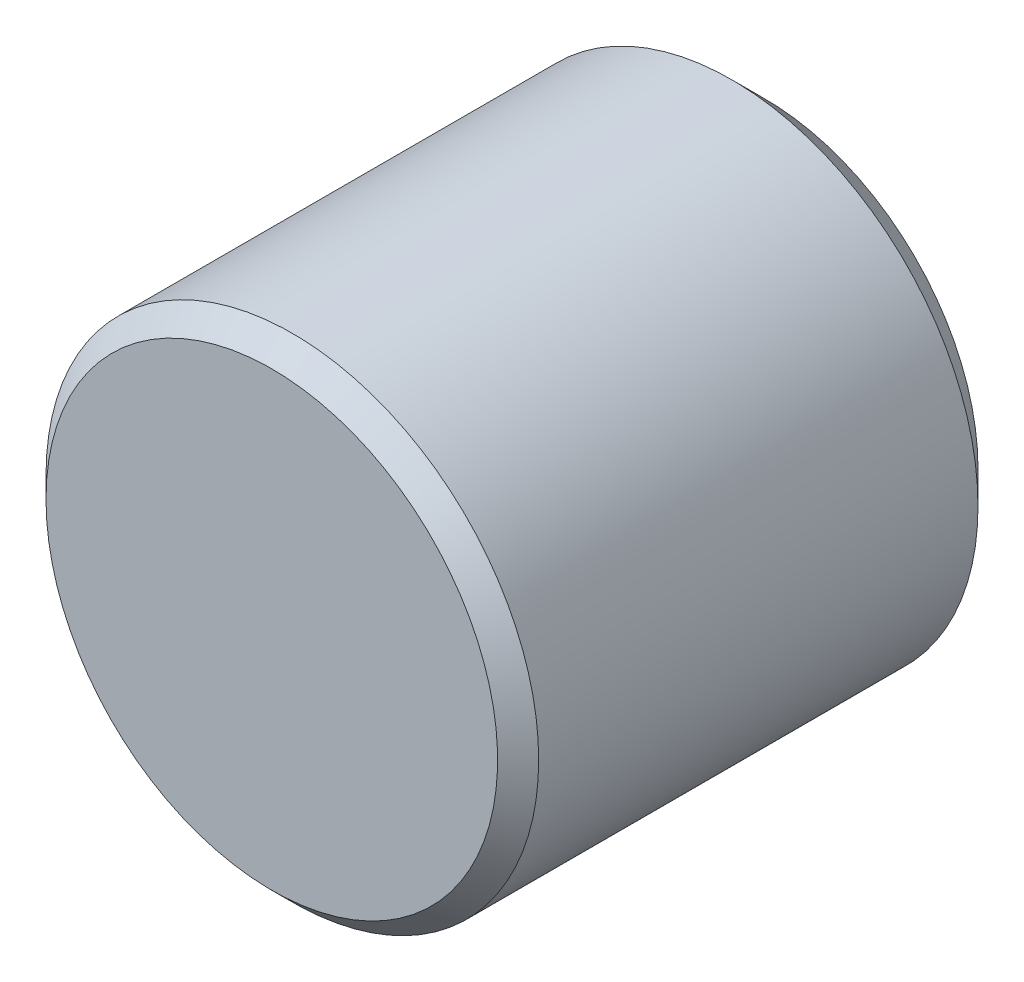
ISO-10303-21;
HEADER;
FILE_DESCRIPTION(('STEP AP214'),'2;1');
FILE_NAME('part.step','',(''),(''),'','','');
FILE_SCHEMA(('AUTOMOTIVE_DESIGN { 1 0 10303 214 1 1 1 1 }'));
ENDSEC;
DATA;
#1=APPLICATION_CONTEXT('core data for automotive mechanical design processes');
#2=APPLICATION_PROTOCOL_DEFINITION('international standard','automotive_design',2000,#1);
#3=PRODUCT_CONTEXT('',#1,'mechanical');
#4=PRODUCT('Part','Part','',(#3));
#5=PRODUCT_RELATED_PRODUCT_CATEGORY('part','',(#4));
#6=PRODUCT_DEFINITION_FORMATION('','',#4);
#7=PRODUCT_DEFINITION_CONTEXT('part definition',#1,'design');
#8=PRODUCT_DEFINITION('design','',#6,#7);
#9=PRODUCT_DEFINITION_SHAPE('','',#8);
#10=(LENGTH_UNIT() NAMED_UNIT(*) SI_UNIT(.MILLI.,.METRE.));
#11=(NAMED_UNIT(*) PLANE_ANGLE_UNIT() SI_UNIT($,.RADIAN.));
#12=(NAMED_UNIT(*) SI_UNIT($,.STERADIAN.) SOLID_ANGLE_UNIT());
#13=UNCERTAINTY_MEASURE_WITH_UNIT(LENGTH_MEASURE(1.E-05),#10,'distance_accuracy_value','');
#14=(GEOMETRIC_REPRESENTATION_CONTEXT(3) GLOBAL_UNCERTAINTY_ASSIGNED_CONTEXT((#13)) GLOBAL_UNIT_ASSIGNED_CONTEXT((#10,
#11,#12)) REPRESENTATION_CONTEXT('',''));
#15=CARTESIAN_POINT('',(0.,0.,0.));
#16=DIRECTION('',(0.,0.,1.));
#17=DIRECTION('',(1.,0.,0.));
#18=AXIS2_PLACEMENT_3D('',#15,#16,#17);
#19=CARTESIAN_POINT('',(0.,0.,32.));
#20=DIRECTION('',(0.,0.,1.));
#21=DIRECTION('',(1.,0.,0.));
#22=AXIS2_PLACEMENT_3D('',#19,#20,#21);
#23=CYLINDRICAL_SURFACE('',#22,6.);
#24=CARTESIAN_POINT('',(0.,0.,0.8));
#25=DIRECTION('',(0.,0.,1.));
#26=DIRECTION('',(1.,0.,0.));
#27=AXIS2_PLACEMENT_3D('',#24,#25,#26);
#28=CIRCLE('',#27,6.);
#29=CARTESIAN_POINT('',(6.,0.,0.8));
#30=VERTEX_POINT('',#29);
#31=EDGE_CURVE('E21',#30,#30,#28,.T.);
#32=ORIENTED_EDGE('',*,*,#31,.T.);
#33=EDGE_LOOP('',(#32));
#34=FACE_BOUND('',#33,.T.);
#35=CARTESIAN_POINT('',(0.,0.,11.5));
#36=DIRECTION('',(0.,0.,-1.));
#37=DIRECTION('',(-1.,0.,0.));
#38=AXIS2_PLACEMENT_3D('',#35,#36,#37);
#39=CIRCLE('',#38,6.);
#40=CARTESIAN_POINT('',(-6.,0.,11.5));
#41=VERTEX_POINT('',#40);
#42=EDGE_CURVE('E27',#41,#41,#39,.T.);
#43=ORIENTED_EDGE('',*,*,#42,.T.);
#44=EDGE_LOOP('',(#43));
#45=FACE_BOUND('',#44,.T.);
#46=ADVANCED_FACE('F13',(#34,#45),#23,.T.);
#47=CARTESIAN_POINT('',(2.5,0.,0.));
#48=DIRECTION('',(0.,0.,1.));
#49=DIRECTION('',(1.,0.,0.));
#50=AXIS2_PLACEMENT_3D('',#47,#48,#49);
#51=PLANE('',#50);
#52=CARTESIAN_POINT('',(0.,0.,0.));
#53=DIRECTION('',(0.,0.,1.));
#54=DIRECTION('',(1.,0.,0.));
#55=AXIS2_PLACEMENT_3D('',#52,#53,#54);
#56=CIRCLE('',#55,5.2);
#57=CARTESIAN_POINT('',(5.2,0.,0.));
#58=VERTEX_POINT('',#57);
#59=EDGE_CURVE('E8',#58,#58,#56,.F.);
#60=ORIENTED_EDGE('',*,*,#59,.T.);
#61=EDGE_LOOP('',(#60));
#62=FACE_BOUND('',#61,.T.);
#63=CARTESIAN_POINT('',(0.,0.,0.));
#64=DIRECTION('',(0.,0.,1.));
#65=DIRECTION('',(1.,0.,0.));
#66=AXIS2_PLACEMENT_3D('',#63,#64,#65);
#67=CIRCLE('',#66,2.5);
#68=CARTESIAN_POINT('',(2.5,0.,0.));
#69=VERTEX_POINT('',#68);
#70=EDGE_CURVE('E38',#69,#69,#67,.T.);
#71=ORIENTED_EDGE('',*,*,#70,.T.);
#72=EDGE_LOOP('',(#71));
#73=FACE_BOUND('',#72,.T.);
#74=ADVANCED_FACE('F62',(#62,#73),#51,.F.);
#75=CARTESIAN_POINT('',(0.,0.,32.));
#76=DIRECTION('',(0.,0.,1.));
#77=DIRECTION('',(1.,0.,0.));
#78=AXIS2_PLACEMENT_3D('',#75,#76,#77);
#79=CYLINDRICAL_SURFACE('',#78,2.5);
#80=ORIENTED_EDGE('',*,*,#70,.F.);
#81=EDGE_LOOP('',(#80));
#82=FACE_BOUND('',#81,.T.);
#83=CARTESIAN_POINT('',(0.,0.,6.4));
#84=DIRECTION('',(0.,0.,1.));
#85=DIRECTION('',(1.,0.,0.));
#86=AXIS2_PLACEMENT_3D('',#83,#84,#85);
#87=CIRCLE('',#86,2.5);
#88=CARTESIAN_POINT('',(2.5,0.,6.4));
#89=VERTEX_POINT('',#88);
#90=EDGE_CURVE('E42',#89,#89,#87,.T.);
#91=ORIENTED_EDGE('',*,*,#90,.T.);
#92=EDGE_LOOP('',(#91));
#93=FACE_BOUND('',#92,.T.);
#94=ADVANCED_FACE('F47',(#82,#93),#79,.F.);
#95=CARTESIAN_POINT('',(0.,0.,6.4));
#96=DIRECTION('',(0.,0.,1.));
#97=DIRECTION('',(1.,0.,0.));
#98=AXIS2_PLACEMENT_3D('',#95,#96,#97);
#99=PLANE('',#98);
#100=ORIENTED_EDGE('',*,*,#90,.F.);
#101=EDGE_LOOP('',(#100));
#102=FACE_BOUND('',#101,.T.);
#103=ADVANCED_FACE('F49',(#102),#99,.F.);
#104=CARTESIAN_POINT('',(6.,0.,12.));
#105=DIRECTION('',(0.,0.,-1.));
#106=DIRECTION('',(-1.,0.,0.));
#107=AXIS2_PLACEMENT_3D('',#104,#105,#106);
#108=PLANE('',#107);
#109=CARTESIAN_POINT('',(0.,0.,12.));
#110=DIRECTION('',(0.,0.,-1.));
#111=DIRECTION('',(-1.,0.,0.));
#112=AXIS2_PLACEMENT_3D('',#109,#110,#111);
#113=CIRCLE('',#112,5.5);
#114=CARTESIAN_POINT('',(-5.5,0.,12.));
#115=VERTEX_POINT('',#114);
#116=EDGE_CURVE('E32',#115,#115,#113,.F.);
#117=ORIENTED_EDGE('',*,*,#116,.T.);
#118=EDGE_LOOP('',(#117));
#119=FACE_BOUND('',#118,.T.);
#120=ADVANCED_FACE('F51',(#119),#108,.F.);
#121=CARTESIAN_POINT('',(0.,0.,12.));
#122=DIRECTION('',(0.,0.,-1.));
#123=DIRECTION('',(-1.,0.,0.));
#124=AXIS2_PLACEMENT_3D('',#121,#122,#123);
#125=CONICAL_SURFACE('',#124,5.5,0.785398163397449);
#126=ORIENTED_EDGE('',*,*,#42,.F.);
#127=EDGE_LOOP('',(#126));
#128=FACE_BOUND('',#127,.T.);
#129=ORIENTED_EDGE('',*,*,#116,.F.);
#130=EDGE_LOOP('',(#129));
#131=FACE_BOUND('',#130,.T.);
#132=ADVANCED_FACE('F59',(#128,#131),#125,.T.);
#133=CARTESIAN_POINT('',(0.,0.,0.8));
#134=DIRECTION('',(0.,0.,1.));
#135=DIRECTION('',(1.,0.,0.));
#136=AXIS2_PLACEMENT_3D('',#133,#134,#135);
#137=CONICAL_SURFACE('',#136,6.,0.785398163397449);
#138=ORIENTED_EDGE('',*,*,#59,.F.);
#139=EDGE_LOOP('',(#138));
#140=FACE_BOUND('',#139,.T.);
#141=ORIENTED_EDGE('',*,*,#31,.F.);
#142=EDGE_LOOP('',(#141));
#143=FACE_BOUND('',#142,.T.);
#144=ADVANCED_FACE('F15',(#140,#143),#137,.T.);
#145=CLOSED_SHELL('',(#46,#74,#94,#103,#120,#132,#144));
#146=MANIFOLD_SOLID_BREP('B1',#145);
#147=ADVANCED_BREP_SHAPE_REPRESENTATION('',(#18,#146),#14);
#148=SHAPE_DEFINITION_REPRESENTATION(#9,#147);
ENDSEC;
END-ISO-10303-21;
